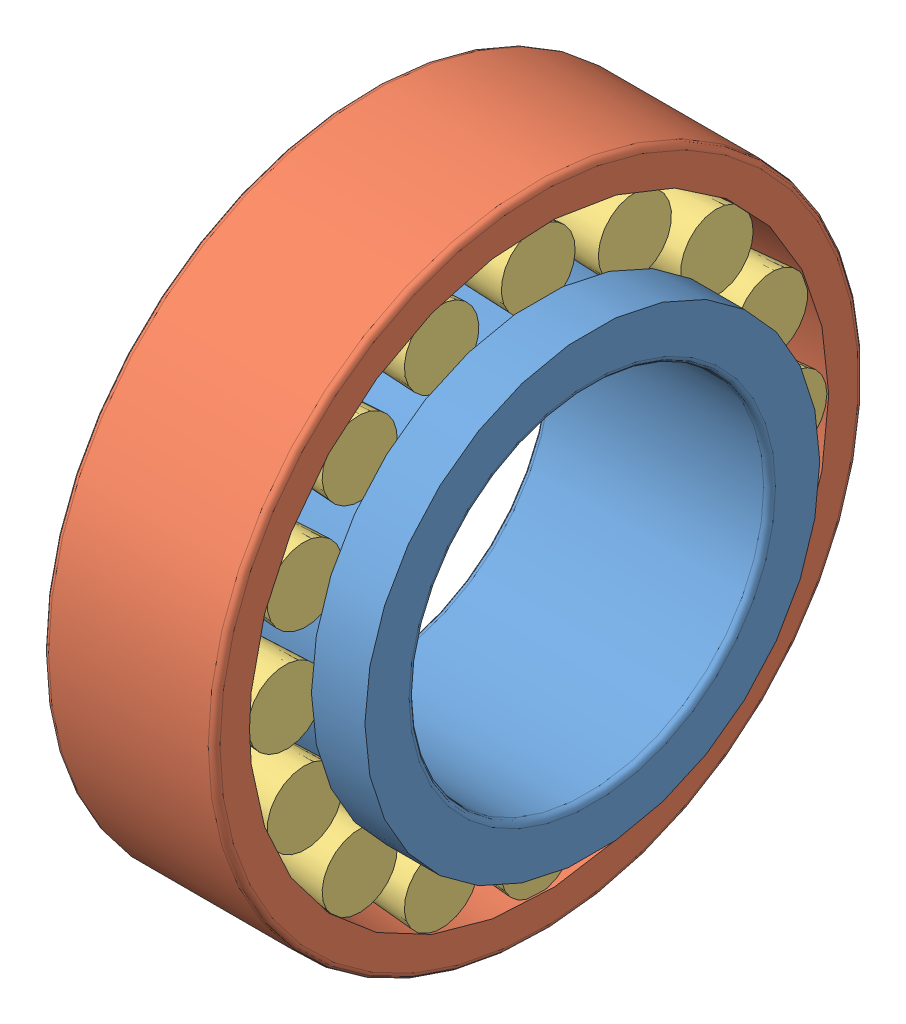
SolidWorks assembly Roulement conique 33212.SLDASM, configuration Défaut (file format 3100). Lengths in mm.
Overall size (38 110 110).
18 component instances, 3 part files, 4 mates.
Components (placement in the parent):
- Roulement_c1ro_Bint33212-1: Roulement_c1ro_Bint33212.SLDPRT [Défaut] at origin size (38 76.97 76.97)
- Roulement_c1ro_Bext33212-1: Roulement_c1ro_Bext33212.SLDPRT [Défaut] at origin size (29 110 110)
- Roulement_c1ro_Eroul33212-1: Roulement_c1ro_Eroul33212.SLDPRT [Défaut] at (19 0 -42.5) size (27.43 12.5 12.5)
- Roulement_c1ro_Eroul33212-2: Roulement_c1ro_Eroul33212.SLDPRT [Défaut] at (19 16.264 -39.2649) x (1 0 0) z (0 -0.382683 0.92388) size (27.43 12.5 12.5)
- Roulement_c1ro_Eroul33212-3: Roulement_c1ro_Eroul33212.SLDPRT [Défaut] at (19 30.052 -30.052) x (1 0 0) z (0 -0.707107 0.707107) size (27.43 12.5 12.5)
- Roulement_c1ro_Eroul33212-4: Roulement_c1ro_Eroul33212.SLDPRT [Défaut] at (19 39.2649 -16.264) x (1 0 0) z (0 -0.92388 0.382683) size (27.43 12.5 12.5)
- Roulement_c1ro_Eroul33212-5: Roulement_c1ro_Eroul33212.SLDPRT [Défaut] at (19 42.5 0) x (1 0 0) z (0 -1 0) size (27.43 12.5 12.5)
- Roulement_c1ro_Eroul33212-6: Roulement_c1ro_Eroul33212.SLDPRT [Défaut] at (19 39.2649 16.264) x (1 0 0) z (0 -0.92388 -0.382683) size (27.43 12.5 12.5)
- Roulement_c1ro_Eroul33212-7: Roulement_c1ro_Eroul33212.SLDPRT [Défaut] at (19 30.052 30.052) x (1 0 0) z (0 -0.707107 -0.707107) size (27.43 12.5 12.5)
- Roulement_c1ro_Eroul33212-8: Roulement_c1ro_Eroul33212.SLDPRT [Défaut] at (19 16.264 39.2649) x (1 0 0) z (0 -0.382683 -0.92388) size (27.43 12.5 12.5)
- Roulement_c1ro_Eroul33212-9: Roulement_c1ro_Eroul33212.SLDPRT [Défaut] at (19 0 42.5) x (1 0 0) z (0 0 -1) size (27.43 12.5 12.5)
- Roulement_c1ro_Eroul33212-10: Roulement_c1ro_Eroul33212.SLDPRT [Défaut] at (19 -16.264 39.2649) x (1 0 0) z (0 0.382683 -0.92388) size (27.43 12.5 12.5)
- Roulement_c1ro_Eroul33212-11: Roulement_c1ro_Eroul33212.SLDPRT [Défaut] at (19 -30.052 30.052) x (1 0 0) z (0 0.707107 -0.707107) size (27.43 12.5 12.5)
- Roulement_c1ro_Eroul33212-12: Roulement_c1ro_Eroul33212.SLDPRT [Défaut] at (19 -39.2649 16.264) x (1 0 0) z (0 0.92388 -0.382683) size (27.43 12.5 12.5)
- Roulement_c1ro_Eroul33212-13: Roulement_c1ro_Eroul33212.SLDPRT [Défaut] at (19 -42.5 0) x (1 0 0) z (0 1 0) size (27.43 12.5 12.5)
- Roulement_c1ro_Eroul33212-14: Roulement_c1ro_Eroul33212.SLDPRT [Défaut] at (19 -39.2649 -16.264) x (1 0 0) z (0 0.92388 0.382683) size (27.43 12.5 12.5)
- Roulement_c1ro_Eroul33212-15: Roulement_c1ro_Eroul33212.SLDPRT [Défaut] at (19 -30.052 -30.052) x (1 0 0) z (0 0.707107 0.707107) size (27.43 12.5 12.5)
- Roulement_c1ro_Eroul33212-16: Roulement_c1ro_Eroul33212.SLDPRT [Défaut] at (19 -16.264 -39.2649) x (1 0 0) z (0 0.382683 0.92388) size (27.43 12.5 12.5)
Mates (geometry in assembly coordinates):
- Coïncidente1: coincident: point of ?
- Coïncidente2: coincident: unknown of ?
- Coïncidente4: coincident: point of Roulement_c1ro_Eroul33212-1; point of assembly
- Parallèle1: parallel = 29.4109 mm aligned: plane of ? through (0 0 0) normal (1 0 0); unknown of ?
